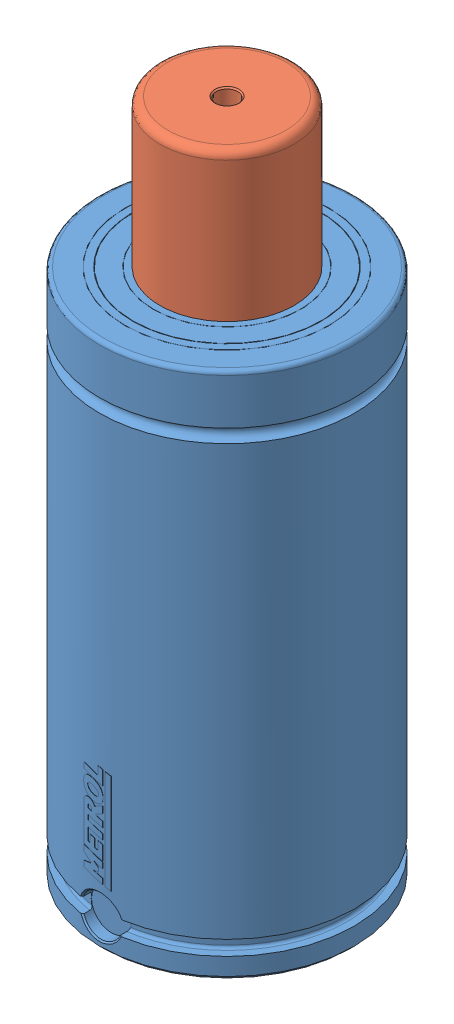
SolidWorks assembly ISNG3000-080.SLDASM, configuration Default (file format 7000). Lengths in mm.
Overall size (95 252.07 95.11).
2 component instances, 2 part files, 5 mates.
Components (placement in the parent):
- ISNG-3000 Body-1: ISNG-3000 Body.SLDPRT [ISNG-3000-80] x (0 0 1) z (0 -1 0) size (95.11 95 197)
- ISNG-3000 Piston-1: ISNG-3000 Piston.SLDPRT [ISNG-3000-80] at (0 144.067 0) x (0.068652 0 0.997641) z (0 -1 0) size (60 60 108)
Mates (geometry in assembly coordinates):
- Concentric1: concentric aligned: cylinder of ISNG-3000 Body-1 through (0 0 0) axis (0 -1 0) radius 25; cylinder of ISNG-3000 Piston-1 through (0 144.067 0) axis (0 -1 0) radius 25
- LimitDistance1: limit distance = 27.933 mm anti-aligned: plane of ISNG-3000 Body-1 through (-25 177 0) normal (0 -1 0); plane of ISNG-3000 Piston-1 through (-29.9292 149.067 2.0596) normal (0 1 0)
- Coincident1: coincident anti-aligned: plane of ISNG-3000 Body-1 through (0 0 0) normal (0 -1 0); plane of assembly through (0 0 0) normal (0 1 0)
- Coincident2: coincident aligned: plane of ISNG-3000 Body-1; plane of assembly through (0 0 0) normal (0 0 1)
- Coincident3: coincident anti-aligned: plane of ISNG-3000 Body-1; plane of assembly through (0 0 0) normal (1 0 0)
